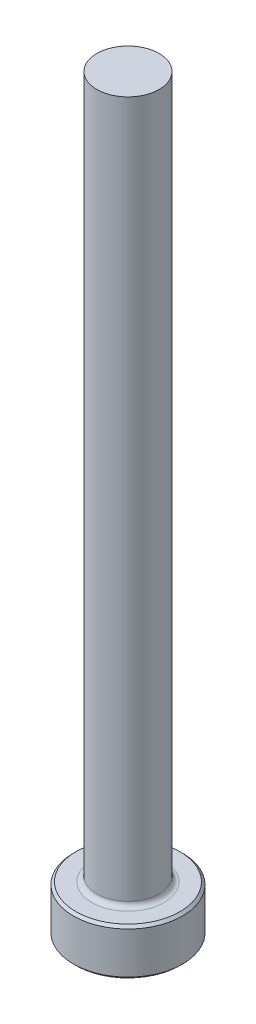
ISO-10303-21;
HEADER;
FILE_DESCRIPTION(('STEP AP214'),'2;1');
FILE_NAME('part.step','',(''),(''),'','','');
FILE_SCHEMA(('AUTOMOTIVE_DESIGN { 1 0 10303 214 1 1 1 1 }'));
ENDSEC;
DATA;
#1=APPLICATION_CONTEXT('core data for automotive mechanical design processes');
#2=APPLICATION_PROTOCOL_DEFINITION('international standard','automotive_design',2000,#1);
#3=PRODUCT_CONTEXT('',#1,'mechanical');
#4=PRODUCT('Part','Part','',(#3));
#5=PRODUCT_RELATED_PRODUCT_CATEGORY('part','',(#4));
#6=PRODUCT_DEFINITION_FORMATION('','',#4);
#7=PRODUCT_DEFINITION_CONTEXT('part definition',#1,'design');
#8=PRODUCT_DEFINITION('design','',#6,#7);
#9=PRODUCT_DEFINITION_SHAPE('','',#8);
#10=(LENGTH_UNIT() NAMED_UNIT(*) SI_UNIT(.MILLI.,.METRE.));
#11=(NAMED_UNIT(*) PLANE_ANGLE_UNIT() SI_UNIT($,.RADIAN.));
#12=(NAMED_UNIT(*) SI_UNIT($,.STERADIAN.) SOLID_ANGLE_UNIT());
#13=UNCERTAINTY_MEASURE_WITH_UNIT(LENGTH_MEASURE(1.E-05),#10,'distance_accuracy_value','');
#14=(GEOMETRIC_REPRESENTATION_CONTEXT(3) GLOBAL_UNCERTAINTY_ASSIGNED_CONTEXT((#13)) GLOBAL_UNIT_ASSIGNED_CONTEXT((#10,
#11,#12)) REPRESENTATION_CONTEXT('',''));
#15=CARTESIAN_POINT('',(0.,0.,0.));
#16=DIRECTION('',(0.,0.,1.));
#17=DIRECTION('',(1.,0.,0.));
#18=AXIS2_PLACEMENT_3D('',#15,#16,#17);
#19=CARTESIAN_POINT('',(0.,0.,0.));
#20=DIRECTION('',(0.,-1.,0.));
#21=DIRECTION('',(0.,0.,-1.));
#22=AXIS2_PLACEMENT_3D('',#19,#20,#21);
#23=PLANE('',#22);
#24=CARTESIAN_POINT('',(0.,0.,0.));
#25=DIRECTION('',(0.,-1.,0.));
#26=DIRECTION('',(0.,0.,-1.));
#27=AXIS2_PLACEMENT_3D('',#24,#25,#26);
#28=CIRCLE('',#27,5.29589999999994);
#29=CARTESIAN_POINT('',(0.,0.,-5.29589999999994));
#30=VERTEX_POINT('',#29);
#31=EDGE_CURVE('E46',#30,#30,#28,.T.);
#32=ORIENTED_EDGE('',*,*,#31,.T.);
#33=EDGE_LOOP('',(#32));
#34=FACE_BOUND('',#33,.T.);
#35=ADVANCED_FACE('F35',(#34),#23,.T.);
#36=CARTESIAN_POINT('',(0.,259.958771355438,0.));
#37=DIRECTION('',(0.,1.,0.));
#38=DIRECTION('',(0.,0.,1.));
#39=AXIS2_PLACEMENT_3D('',#36,#37,#38);
#40=CYLINDRICAL_SURFACE('',#39,5.54989999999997);
#41=CARTESIAN_POINT('',(0.,4.49580000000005,0.));
#42=DIRECTION('',(0.,1.,0.));
#43=DIRECTION('',(0.,0.,1.));
#44=AXIS2_PLACEMENT_3D('',#41,#42,#43);
#45=CIRCLE('',#44,5.54989999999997);
#46=CARTESIAN_POINT('',(0.,4.49580000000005,5.54989999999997));
#47=VERTEX_POINT('',#46);
#48=EDGE_CURVE('E50',#47,#47,#45,.F.);
#49=ORIENTED_EDGE('',*,*,#48,.T.);
#50=EDGE_LOOP('',(#49));
#51=FACE_BOUND('',#50,.T.);
#52=CARTESIAN_POINT('',(0.,0.254000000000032,0.));
#53=DIRECTION('',(0.,-1.,0.));
#54=DIRECTION('',(0.,0.,-1.));
#55=AXIS2_PLACEMENT_3D('',#52,#53,#54);
#56=CIRCLE('',#55,5.54989999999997);
#57=CARTESIAN_POINT('',(0.,0.254000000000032,-5.54989999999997));
#58=VERTEX_POINT('',#57);
#59=EDGE_CURVE('E55',#58,#58,#56,.F.);
#60=ORIENTED_EDGE('',*,*,#59,.T.);
#61=EDGE_LOOP('',(#60));
#62=FACE_BOUND('',#61,.T.);
#63=ADVANCED_FACE('F77',(#51,#62),#40,.T.);
#64=CARTESIAN_POINT('',(-5.54989999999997,4.7498,0.));
#65=DIRECTION('',(0.,1.,0.));
#66=DIRECTION('',(0.,0.,1.));
#67=AXIS2_PLACEMENT_3D('',#64,#65,#66);
#68=PLANE('',#67);
#69=CARTESIAN_POINT('',(0.,4.7498,0.));
#70=DIRECTION('',(0.,1.,0.));
#71=DIRECTION('',(0.,0.,1.));
#72=AXIS2_PLACEMENT_3D('',#69,#70,#71);
#73=CIRCLE('',#72,3.68299999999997);
#74=CARTESIAN_POINT('',(0.,4.7498,3.68299999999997));
#75=VERTEX_POINT('',#74);
#76=EDGE_CURVE('E10',#75,#75,#73,.F.);
#77=ORIENTED_EDGE('',*,*,#76,.T.);
#78=EDGE_LOOP('',(#77));
#79=FACE_BOUND('',#78,.T.);
#80=CARTESIAN_POINT('',(0.,4.7498,0.));
#81=DIRECTION('',(0.,1.,0.));
#82=DIRECTION('',(0.,0.,1.));
#83=AXIS2_PLACEMENT_3D('',#80,#81,#82);
#84=CIRCLE('',#83,5.29590000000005);
#85=CARTESIAN_POINT('',(0.,4.7498,5.29590000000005));
#86=VERTEX_POINT('',#85);
#87=EDGE_CURVE('E58',#86,#86,#84,.T.);
#88=ORIENTED_EDGE('',*,*,#87,.T.);
#89=EDGE_LOOP('',(#88));
#90=FACE_BOUND('',#89,.T.);
#91=ADVANCED_FACE('F69',(#79,#90),#68,.T.);
#92=CARTESIAN_POINT('',(0.,259.958771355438,0.));
#93=DIRECTION('',(0.,1.,0.));
#94=DIRECTION('',(0.,0.,1.));
#95=AXIS2_PLACEMENT_3D('',#92,#93,#94);
#96=CYLINDRICAL_SURFACE('',#95,3.17499999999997);
#97=CARTESIAN_POINT('',(0.,5.25779999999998,0.));
#98=DIRECTION('',(0.,1.,0.));
#99=DIRECTION('',(0.,0.,1.));
#100=AXIS2_PLACEMENT_3D('',#97,#98,#99);
#101=CIRCLE('',#100,3.17499999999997);
#102=CARTESIAN_POINT('',(0.,5.25779999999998,3.17499999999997));
#103=VERTEX_POINT('',#102);
#104=EDGE_CURVE('E42',#103,#103,#101,.T.);
#105=ORIENTED_EDGE('',*,*,#104,.T.);
#106=EDGE_LOOP('',(#105));
#107=FACE_BOUND('',#106,.T.);
#108=CARTESIAN_POINT('',(0.,76.2,0.));
#109=DIRECTION('',(0.,1.,0.));
#110=DIRECTION('',(0.,0.,1.));
#111=AXIS2_PLACEMENT_3D('',#108,#109,#110);
#112=CIRCLE('',#111,3.17499999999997);
#113=CARTESIAN_POINT('',(0.,76.2,3.17499999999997));
#114=VERTEX_POINT('',#113);
#115=EDGE_CURVE('E61',#114,#114,#112,.T.);
#116=ORIENTED_EDGE('',*,*,#115,.F.);
#117=EDGE_LOOP('',(#116));
#118=FACE_BOUND('',#117,.T.);
#119=ADVANCED_FACE('F67',(#107,#118),#96,.T.);
#120=CARTESIAN_POINT('',(-3.17499999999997,76.2,0.));
#121=DIRECTION('',(0.,1.,0.));
#122=DIRECTION('',(0.,0.,1.));
#123=AXIS2_PLACEMENT_3D('',#120,#121,#122);
#124=PLANE('',#123);
#125=ORIENTED_EDGE('',*,*,#115,.T.);
#126=EDGE_LOOP('',(#125));
#127=FACE_BOUND('',#126,.T.);
#128=ADVANCED_FACE('F65',(#127),#124,.T.);
#129=CARTESIAN_POINT('',(0.,4.74980000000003,0.));
#130=DIRECTION('',(0.,-1.,0.));
#131=DIRECTION('',(0.,0.,-1.));
#132=AXIS2_PLACEMENT_3D('',#129,#130,#131);
#133=CONICAL_SURFACE('',#132,5.29590000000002,0.785398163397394);
#134=ORIENTED_EDGE('',*,*,#48,.F.);
#135=EDGE_LOOP('',(#134));
#136=FACE_BOUND('',#135,.T.);
#137=ORIENTED_EDGE('',*,*,#87,.F.);
#138=EDGE_LOOP('',(#137));
#139=FACE_BOUND('',#138,.T.);
#140=ADVANCED_FACE('F75',(#136,#139),#133,.T.);
#141=CARTESIAN_POINT('',(0.,0.254000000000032,0.));
#142=DIRECTION('',(0.,1.,0.));
#143=DIRECTION('',(0.,0.,1.));
#144=AXIS2_PLACEMENT_3D('',#141,#142,#143);
#145=CONICAL_SURFACE('',#144,5.54989999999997,0.785398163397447);
#146=ORIENTED_EDGE('',*,*,#31,.F.);
#147=EDGE_LOOP('',(#146));
#148=FACE_BOUND('',#147,.T.);
#149=ORIENTED_EDGE('',*,*,#59,.F.);
#150=EDGE_LOOP('',(#149));
#151=FACE_BOUND('',#150,.T.);
#152=ADVANCED_FACE('F89',(#148,#151),#145,.T.);
#153=CARTESIAN_POINT('',(0.,5.25779999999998,0.));
#154=DIRECTION('',(0.,1.,0.));
#155=DIRECTION('',(0.,0.,1.));
#156=AXIS2_PLACEMENT_3D('',#153,#154,#155);
#157=TOROIDAL_SURFACE('',#156,3.68299999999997,0.508);
#158=ORIENTED_EDGE('',*,*,#76,.F.);
#159=EDGE_LOOP('',(#158));
#160=FACE_BOUND('',#159,.T.);
#161=ORIENTED_EDGE('',*,*,#104,.F.);
#162=EDGE_LOOP('',(#161));
#163=FACE_BOUND('',#162,.T.);
#164=ADVANCED_FACE('F37',(#160,#163),#157,.F.);
#165=CLOSED_SHELL('',(#35,#63,#91,#119,#128,#140,#152,#164));
#166=MANIFOLD_SOLID_BREP('B2',#165);
#167=ADVANCED_BREP_SHAPE_REPRESENTATION('',(#18,#166),#14);
#168=SHAPE_DEFINITION_REPRESENTATION(#9,#167);
ENDSEC;
END-ISO-10303-21;
